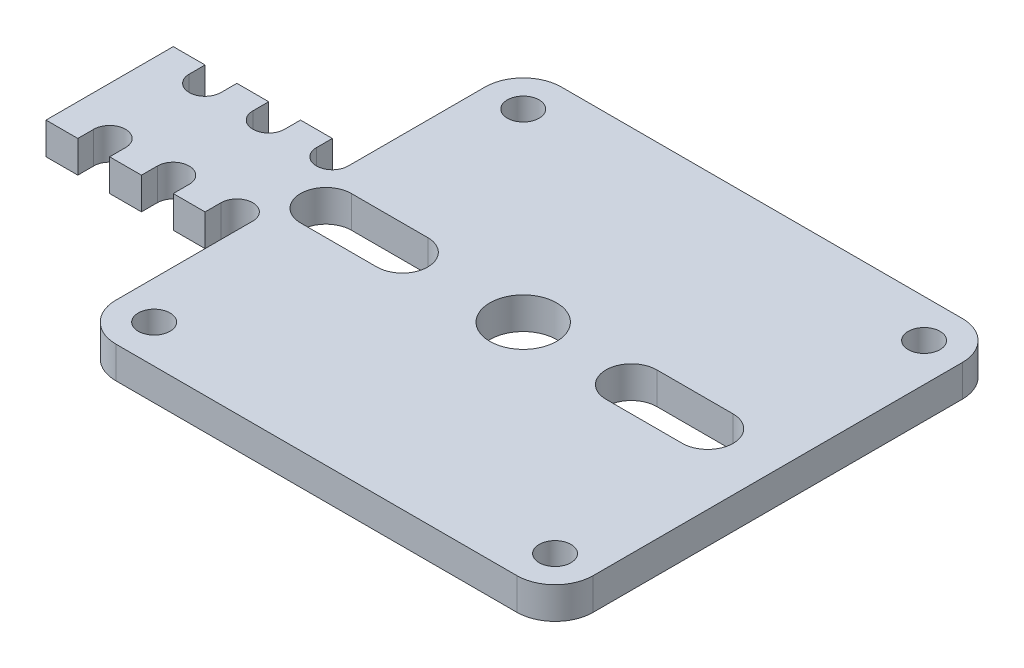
ISO-10303-21;
HEADER;
FILE_DESCRIPTION(('STEP AP214'),'2;1');
FILE_NAME('part.step','',(''),(''),'','','');
FILE_SCHEMA(('AUTOMOTIVE_DESIGN { 1 0 10303 214 1 1 1 1 }'));
ENDSEC;
DATA;
#1=APPLICATION_CONTEXT('core data for automotive mechanical design processes');
#2=APPLICATION_PROTOCOL_DEFINITION('international standard','automotive_design',2000,#1);
#3=PRODUCT_CONTEXT('',#1,'mechanical');
#4=PRODUCT('Part','Part','',(#3));
#5=PRODUCT_RELATED_PRODUCT_CATEGORY('part','',(#4));
#6=PRODUCT_DEFINITION_FORMATION('','',#4);
#7=PRODUCT_DEFINITION_CONTEXT('part definition',#1,'design');
#8=PRODUCT_DEFINITION('design','',#6,#7);
#9=PRODUCT_DEFINITION_SHAPE('','',#8);
#10=(LENGTH_UNIT() NAMED_UNIT(*) SI_UNIT(.MILLI.,.METRE.));
#11=(NAMED_UNIT(*) PLANE_ANGLE_UNIT() SI_UNIT($,.RADIAN.));
#12=(NAMED_UNIT(*) SI_UNIT($,.STERADIAN.) SOLID_ANGLE_UNIT());
#13=UNCERTAINTY_MEASURE_WITH_UNIT(LENGTH_MEASURE(1.E-05),#10,'distance_accuracy_value','');
#14=(GEOMETRIC_REPRESENTATION_CONTEXT(3) GLOBAL_UNCERTAINTY_ASSIGNED_CONTEXT((#13)) GLOBAL_UNIT_ASSIGNED_CONTEXT((#10,
#11,#12)) REPRESENTATION_CONTEXT('',''));
#15=CARTESIAN_POINT('',(0.,0.,0.));
#16=DIRECTION('',(0.,0.,1.));
#17=DIRECTION('',(1.,0.,0.));
#18=AXIS2_PLACEMENT_3D('',#15,#16,#17);
#19=CARTESIAN_POINT('',(36.,5.,-64.));
#20=DIRECTION('',(0.,-1.,0.));
#21=DIRECTION('',(0.,0.,-1.));
#22=AXIS2_PLACEMENT_3D('',#19,#20,#21);
#23=PLANE('',#22);
#24=CARTESIAN_POINT('',(36.,5.,-6.));
#25=DIRECTION('',(0.,1.,0.));
#26=DIRECTION('',(0.,0.,1.));
#27=AXIS2_PLACEMENT_3D('',#24,#25,#26);
#28=CIRCLE('',#27,2.5);
#29=CARTESIAN_POINT('',(36.,5.,-3.5));
#30=VERTEX_POINT('',#29);
#31=EDGE_CURVE('E1160',#30,#30,#28,.T.);
#32=ORIENTED_EDGE('',*,*,#31,.F.);
#33=EDGE_LOOP('',(#32));
#34=FACE_BOUND('',#33,.T.);
#35=CARTESIAN_POINT('',(99.,5.,-64.));
#36=DIRECTION('',(0.,1.,0.));
#37=DIRECTION('',(0.,0.,1.));
#38=AXIS2_PLACEMENT_3D('',#35,#36,#37);
#39=CIRCLE('',#38,2.50000000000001);
#40=CARTESIAN_POINT('',(99.,5.,-61.5));
#41=VERTEX_POINT('',#40);
#42=EDGE_CURVE('E1172',#41,#41,#39,.T.);
#43=ORIENTED_EDGE('',*,*,#42,.F.);
#44=EDGE_LOOP('',(#43));
#45=FACE_BOUND('',#44,.T.);
#46=CARTESIAN_POINT('',(82.,5.,-35.));
#47=DIRECTION('',(0.,1.,0.));
#48=DIRECTION('',(0.,0.,1.));
#49=AXIS2_PLACEMENT_3D('',#46,#47,#48);
#50=CIRCLE('',#49,4.);
#51=CARTESIAN_POINT('',(82.,5.,-39.));
#52=VERTEX_POINT('',#51);
#53=CARTESIAN_POINT('',(82.,5.,-31.));
#54=VERTEX_POINT('',#53);
#55=EDGE_CURVE('E306',#52,#54,#50,.T.);
#56=ORIENTED_EDGE('',*,*,#55,.F.);
#57=DIRECTION('',(-1.,0.,0.));
#58=VECTOR('',#57,1.);
#59=CARTESIAN_POINT('',(82.,5.,-39.));
#60=LINE('',#59,#58);
#61=CARTESIAN_POINT('',(94.,5.,-39.));
#62=VERTEX_POINT('',#61);
#63=EDGE_CURVE('E327',#62,#52,#60,.T.);
#64=ORIENTED_EDGE('',*,*,#63,.F.);
#65=CARTESIAN_POINT('',(94.,5.,-35.));
#66=DIRECTION('',(0.,1.,0.));
#67=DIRECTION('',(0.,0.,1.));
#68=AXIS2_PLACEMENT_3D('',#65,#66,#67);
#69=CIRCLE('',#68,4.);
#70=CARTESIAN_POINT('',(94.,5.,-31.));
#71=VERTEX_POINT('',#70);
#72=EDGE_CURVE('E325',#71,#62,#69,.T.);
#73=ORIENTED_EDGE('',*,*,#72,.F.);
#74=DIRECTION('',(1.,0.,0.));
#75=VECTOR('',#74,1.);
#76=CARTESIAN_POINT('',(82.,5.,-31.));
#77=LINE('',#76,#75);
#78=EDGE_CURVE('E323',#54,#71,#77,.T.);
#79=ORIENTED_EDGE('',*,*,#78,.F.);
#80=EDGE_LOOP('',(#56,#64,#73,#79));
#81=FACE_BOUND('',#80,.T.);
#82=CARTESIAN_POINT('',(36.,5.,-64.));
#83=DIRECTION('',(0.,1.,0.));
#84=DIRECTION('',(0.,0.,-1.));
#85=AXIS2_PLACEMENT_3D('',#82,#83,#84);
#86=CIRCLE('',#85,6.);
#87=CARTESIAN_POINT('',(36.,5.,-70.));
#88=VERTEX_POINT('',#87);
#89=CARTESIAN_POINT('',(30.,5.,-64.));
#90=VERTEX_POINT('',#89);
#91=EDGE_CURVE('E428',#88,#90,#86,.T.);
#92=ORIENTED_EDGE('',*,*,#91,.T.);
#93=DIRECTION('',(0.,0.,1.));
#94=VECTOR('',#93,1.);
#95=CARTESIAN_POINT('',(30.,5.,-42.5));
#96=LINE('',#95,#94);
#97=CARTESIAN_POINT('',(30.,5.,-42.5));
#98=VERTEX_POINT('',#97);
#99=EDGE_CURVE('E431',#90,#98,#96,.T.);
#100=ORIENTED_EDGE('',*,*,#99,.T.);
#101=CARTESIAN_POINT('',(27.5,5.,-42.5));
#102=DIRECTION('',(0.,-1.,0.));
#103=DIRECTION('',(0.,0.,1.));
#104=AXIS2_PLACEMENT_3D('',#101,#102,#103);
#105=CIRCLE('',#104,2.5);
#106=CARTESIAN_POINT('',(25.,5.,-42.5));
#107=VERTEX_POINT('',#106);
#108=EDGE_CURVE('E433',#98,#107,#105,.T.);
#109=ORIENTED_EDGE('',*,*,#108,.T.);
#110=DIRECTION('',(0.,0.,-1.));
#111=VECTOR('',#110,1.);
#112=CARTESIAN_POINT('',(25.,5.,-42.5));
#113=LINE('',#112,#111);
#114=CARTESIAN_POINT('',(25.,5.,-45.));
#115=VERTEX_POINT('',#114);
#116=EDGE_CURVE('E435',#107,#115,#113,.T.);
#117=ORIENTED_EDGE('',*,*,#116,.T.);
#118=DIRECTION('',(-1.,0.,0.));
#119=VECTOR('',#118,1.);
#120=CARTESIAN_POINT('',(20.,5.,-45.));
#121=LINE('',#120,#119);
#122=CARTESIAN_POINT('',(20.,5.,-45.));
#123=VERTEX_POINT('',#122);
#124=EDGE_CURVE('E437',#115,#123,#121,.T.);
#125=ORIENTED_EDGE('',*,*,#124,.T.);
#126=DIRECTION('',(0.,0.,1.));
#127=VECTOR('',#126,1.);
#128=CARTESIAN_POINT('',(20.,5.,-42.5));
#129=LINE('',#128,#127);
#130=CARTESIAN_POINT('',(20.,5.,-42.5));
#131=VERTEX_POINT('',#130);
#132=EDGE_CURVE('E439',#123,#131,#129,.T.);
#133=ORIENTED_EDGE('',*,*,#132,.T.);
#134=CARTESIAN_POINT('',(17.5,5.,-42.5));
#135=DIRECTION('',(0.,-1.,0.));
#136=DIRECTION('',(0.,0.,1.));
#137=AXIS2_PLACEMENT_3D('',#134,#135,#136);
#138=CIRCLE('',#137,2.5);
#139=CARTESIAN_POINT('',(15.,5.,-42.5));
#140=VERTEX_POINT('',#139);
#141=EDGE_CURVE('E441',#131,#140,#138,.T.);
#142=ORIENTED_EDGE('',*,*,#141,.T.);
#143=DIRECTION('',(0.,0.,-1.));
#144=VECTOR('',#143,1.);
#145=CARTESIAN_POINT('',(15.,5.,-42.5));
#146=LINE('',#145,#144);
#147=CARTESIAN_POINT('',(15.,5.,-45.));
#148=VERTEX_POINT('',#147);
#149=EDGE_CURVE('E443',#140,#148,#146,.T.);
#150=ORIENTED_EDGE('',*,*,#149,.T.);
#151=DIRECTION('',(-1.,0.,0.));
#152=VECTOR('',#151,1.);
#153=CARTESIAN_POINT('',(10.,5.,-45.));
#154=LINE('',#153,#152);
#155=CARTESIAN_POINT('',(10.,5.,-45.));
#156=VERTEX_POINT('',#155);
#157=EDGE_CURVE('E445',#148,#156,#154,.T.);
#158=ORIENTED_EDGE('',*,*,#157,.T.);
#159=DIRECTION('',(0.,0.,1.));
#160=VECTOR('',#159,1.);
#161=CARTESIAN_POINT('',(10.,5.,-42.5));
#162=LINE('',#161,#160);
#163=CARTESIAN_POINT('',(10.,5.,-42.5));
#164=VERTEX_POINT('',#163);
#165=EDGE_CURVE('E447',#156,#164,#162,.T.);
#166=ORIENTED_EDGE('',*,*,#165,.T.);
#167=CARTESIAN_POINT('',(7.5,5.,-42.5));
#168=DIRECTION('',(0.,-1.,0.));
#169=DIRECTION('',(0.,0.,1.));
#170=AXIS2_PLACEMENT_3D('',#167,#168,#169);
#171=CIRCLE('',#170,2.5);
#172=CARTESIAN_POINT('',(5.,5.,-42.5));
#173=VERTEX_POINT('',#172);
#174=EDGE_CURVE('E449',#164,#173,#171,.T.);
#175=ORIENTED_EDGE('',*,*,#174,.T.);
#176=DIRECTION('',(0.,0.,-1.));
#177=VECTOR('',#176,1.);
#178=CARTESIAN_POINT('',(5.,5.,-42.5));
#179=LINE('',#178,#177);
#180=CARTESIAN_POINT('',(5.,5.,-45.));
#181=VERTEX_POINT('',#180);
#182=EDGE_CURVE('E451',#173,#181,#179,.T.);
#183=ORIENTED_EDGE('',*,*,#182,.T.);
#184=DIRECTION('',(-1.,0.,0.));
#185=VECTOR('',#184,1.);
#186=CARTESIAN_POINT('',(0.,5.,-45.));
#187=LINE('',#186,#185);
#188=CARTESIAN_POINT('',(0.,5.,-45.));
#189=VERTEX_POINT('',#188);
#190=EDGE_CURVE('E453',#181,#189,#187,.T.);
#191=ORIENTED_EDGE('',*,*,#190,.T.);
#192=DIRECTION('',(0.,0.,1.));
#193=VECTOR('',#192,1.);
#194=CARTESIAN_POINT('',(0.,5.,-25.));
#195=LINE('',#194,#193);
#196=CARTESIAN_POINT('',(0.,5.,-25.));
#197=VERTEX_POINT('',#196);
#198=EDGE_CURVE('E455',#189,#197,#195,.T.);
#199=ORIENTED_EDGE('',*,*,#198,.T.);
#200=DIRECTION('',(1.,0.,0.));
#201=VECTOR('',#200,1.);
#202=CARTESIAN_POINT('',(0.,5.,-25.));
#203=LINE('',#202,#201);
#204=CARTESIAN_POINT('',(5.,5.,-25.));
#205=VERTEX_POINT('',#204);
#206=EDGE_CURVE('E457',#197,#205,#203,.T.);
#207=ORIENTED_EDGE('',*,*,#206,.T.);
#208=DIRECTION('',(0.,0.,-1.));
#209=VECTOR('',#208,1.);
#210=CARTESIAN_POINT('',(5.,5.,-27.5));
#211=LINE('',#210,#209);
#212=CARTESIAN_POINT('',(5.,5.,-27.5));
#213=VERTEX_POINT('',#212);
#214=EDGE_CURVE('E459',#205,#213,#211,.T.);
#215=ORIENTED_EDGE('',*,*,#214,.T.);
#216=CARTESIAN_POINT('',(7.5,5.,-27.5));
#217=DIRECTION('',(0.,-1.,0.));
#218=DIRECTION('',(0.,0.,1.));
#219=AXIS2_PLACEMENT_3D('',#216,#217,#218);
#220=CIRCLE('',#219,2.5);
#221=CARTESIAN_POINT('',(10.,5.,-27.5));
#222=VERTEX_POINT('',#221);
#223=EDGE_CURVE('E461',#213,#222,#220,.T.);
#224=ORIENTED_EDGE('',*,*,#223,.T.);
#225=DIRECTION('',(0.,0.,1.));
#226=VECTOR('',#225,1.);
#227=CARTESIAN_POINT('',(10.,5.,-27.5));
#228=LINE('',#227,#226);
#229=CARTESIAN_POINT('',(10.,5.,-25.));
#230=VERTEX_POINT('',#229);
#231=EDGE_CURVE('E463',#222,#230,#228,.T.);
#232=ORIENTED_EDGE('',*,*,#231,.T.);
#233=DIRECTION('',(1.,0.,0.));
#234=VECTOR('',#233,1.);
#235=CARTESIAN_POINT('',(10.,5.,-25.));
#236=LINE('',#235,#234);
#237=CARTESIAN_POINT('',(15.,5.,-25.));
#238=VERTEX_POINT('',#237);
#239=EDGE_CURVE('E465',#230,#238,#236,.T.);
#240=ORIENTED_EDGE('',*,*,#239,.T.);
#241=DIRECTION('',(0.,0.,-1.));
#242=VECTOR('',#241,1.);
#243=CARTESIAN_POINT('',(15.,5.,-27.5));
#244=LINE('',#243,#242);
#245=CARTESIAN_POINT('',(15.,5.,-27.5));
#246=VERTEX_POINT('',#245);
#247=EDGE_CURVE('E467',#238,#246,#244,.T.);
#248=ORIENTED_EDGE('',*,*,#247,.T.);
#249=CARTESIAN_POINT('',(17.5,5.,-27.5));
#250=DIRECTION('',(0.,-1.,0.));
#251=DIRECTION('',(0.,0.,1.));
#252=AXIS2_PLACEMENT_3D('',#249,#250,#251);
#253=CIRCLE('',#252,2.5);
#254=CARTESIAN_POINT('',(20.,5.,-27.5));
#255=VERTEX_POINT('',#254);
#256=EDGE_CURVE('E469',#246,#255,#253,.T.);
#257=ORIENTED_EDGE('',*,*,#256,.T.);
#258=DIRECTION('',(0.,0.,1.));
#259=VECTOR('',#258,1.);
#260=CARTESIAN_POINT('',(20.,5.,-27.5));
#261=LINE('',#260,#259);
#262=CARTESIAN_POINT('',(20.,5.,-25.));
#263=VERTEX_POINT('',#262);
#264=EDGE_CURVE('E471',#255,#263,#261,.T.);
#265=ORIENTED_EDGE('',*,*,#264,.T.);
#266=DIRECTION('',(1.,0.,0.));
#267=VECTOR('',#266,1.);
#268=CARTESIAN_POINT('',(20.,5.,-25.));
#269=LINE('',#268,#267);
#270=CARTESIAN_POINT('',(25.,5.,-25.));
#271=VERTEX_POINT('',#270);
#272=EDGE_CURVE('E473',#263,#271,#269,.T.);
#273=ORIENTED_EDGE('',*,*,#272,.T.);
#274=DIRECTION('',(0.,0.,-1.));
#275=VECTOR('',#274,1.);
#276=CARTESIAN_POINT('',(25.,5.,-27.5));
#277=LINE('',#276,#275);
#278=CARTESIAN_POINT('',(25.,5.,-27.5));
#279=VERTEX_POINT('',#278);
#280=EDGE_CURVE('E475',#271,#279,#277,.T.);
#281=ORIENTED_EDGE('',*,*,#280,.T.);
#282=CARTESIAN_POINT('',(27.5,5.,-27.5));
#283=DIRECTION('',(0.,-1.,0.));
#284=DIRECTION('',(0.,0.,1.));
#285=AXIS2_PLACEMENT_3D('',#282,#283,#284);
#286=CIRCLE('',#285,2.5);
#287=CARTESIAN_POINT('',(30.,5.,-27.5));
#288=VERTEX_POINT('',#287);
#289=EDGE_CURVE('E477',#279,#288,#286,.T.);
#290=ORIENTED_EDGE('',*,*,#289,.T.);
#291=DIRECTION('',(0.,0.,1.));
#292=VECTOR('',#291,1.);
#293=CARTESIAN_POINT('',(30.,5.,-6.00000000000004));
#294=LINE('',#293,#292);
#295=CARTESIAN_POINT('',(30.,5.,-6.00000000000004));
#296=VERTEX_POINT('',#295);
#297=EDGE_CURVE('E479',#288,#296,#294,.T.);
#298=ORIENTED_EDGE('',*,*,#297,.T.);
#299=CARTESIAN_POINT('',(36.,5.,-6.));
#300=DIRECTION('',(0.,1.,0.));
#301=DIRECTION('',(0.,0.,-1.));
#302=AXIS2_PLACEMENT_3D('',#299,#300,#301);
#303=CIRCLE('',#302,6.);
#304=CARTESIAN_POINT('',(36.,5.,0.));
#305=VERTEX_POINT('',#304);
#306=EDGE_CURVE('E481',#296,#305,#303,.T.);
#307=ORIENTED_EDGE('',*,*,#306,.T.);
#308=DIRECTION('',(1.,0.,0.));
#309=VECTOR('',#308,1.);
#310=CARTESIAN_POINT('',(36.,5.,0.));
#311=LINE('',#310,#309);
#312=CARTESIAN_POINT('',(98.9999999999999,5.,0.));
#313=VERTEX_POINT('',#312);
#314=EDGE_CURVE('E483',#305,#313,#311,.T.);
#315=ORIENTED_EDGE('',*,*,#314,.T.);
#316=CARTESIAN_POINT('',(99.,5.,-6.));
#317=DIRECTION('',(0.,1.,0.));
#318=DIRECTION('',(0.,0.,1.));
#319=AXIS2_PLACEMENT_3D('',#316,#317,#318);
#320=CIRCLE('',#319,6.);
#321=CARTESIAN_POINT('',(105.,5.,-6.00000000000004));
#322=VERTEX_POINT('',#321);
#323=EDGE_CURVE('E485',#313,#322,#320,.T.);
#324=ORIENTED_EDGE('',*,*,#323,.T.);
#325=DIRECTION('',(0.,0.,-1.));
#326=VECTOR('',#325,1.);
#327=CARTESIAN_POINT('',(105.,5.,-6.00000000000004));
#328=LINE('',#327,#326);
#329=CARTESIAN_POINT('',(105.,5.,-64.));
#330=VERTEX_POINT('',#329);
#331=EDGE_CURVE('E487',#322,#330,#328,.T.);
#332=ORIENTED_EDGE('',*,*,#331,.T.);
#333=CARTESIAN_POINT('',(99.,5.,-64.));
#334=DIRECTION('',(0.,1.,0.));
#335=DIRECTION('',(0.,0.,1.));
#336=AXIS2_PLACEMENT_3D('',#333,#334,#335);
#337=CIRCLE('',#336,6.00000000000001);
#338=CARTESIAN_POINT('',(98.9999999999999,5.,-70.));
#339=VERTEX_POINT('',#338);
#340=EDGE_CURVE('E489',#330,#339,#337,.T.);
#341=ORIENTED_EDGE('',*,*,#340,.T.);
#342=DIRECTION('',(-1.,0.,0.));
#343=VECTOR('',#342,1.);
#344=CARTESIAN_POINT('',(36.,5.,-70.));
#345=LINE('',#344,#343);
#346=EDGE_CURVE('E491',#339,#88,#345,.T.);
#347=ORIENTED_EDGE('',*,*,#346,.T.);
#348=EDGE_LOOP('',(#92,#100,#109,#117,#125,#133,#142,#150,#158,#166,#175,#183,#191,#199,#207,
#215,#224,#232,#240,#248,#257,#265,#273,#281,#290,#298,#307,#315,#324,#332,#341,#347));
#349=FACE_BOUND('',#348,.T.);
#350=CARTESIAN_POINT('',(46.,5.,-35.));
#351=DIRECTION('',(0.,1.,0.));
#352=DIRECTION('',(0.,0.,1.));
#353=AXIS2_PLACEMENT_3D('',#350,#351,#352);
#354=CIRCLE('',#353,4.);
#355=CARTESIAN_POINT('',(46.,5.,-31.));
#356=VERTEX_POINT('',#355);
#357=CARTESIAN_POINT('',(46.,5.,-39.));
#358=VERTEX_POINT('',#357);
#359=EDGE_CURVE('E344',#356,#358,#354,.T.);
#360=ORIENTED_EDGE('',*,*,#359,.F.);
#361=DIRECTION('',(1.,0.,0.));
#362=VECTOR('',#361,1.);
#363=CARTESIAN_POINT('',(34.,5.,-31.));
#364=LINE('',#363,#362);
#365=CARTESIAN_POINT('',(34.,5.,-31.));
#366=VERTEX_POINT('',#365);
#367=EDGE_CURVE('E351',#366,#356,#364,.T.);
#368=ORIENTED_EDGE('',*,*,#367,.F.);
#369=CARTESIAN_POINT('',(34.,5.,-35.));
#370=DIRECTION('',(0.,1.,0.));
#371=DIRECTION('',(0.,0.,1.));
#372=AXIS2_PLACEMENT_3D('',#369,#370,#371);
#373=CIRCLE('',#372,4.);
#374=CARTESIAN_POINT('',(34.,5.,-39.));
#375=VERTEX_POINT('',#374);
#376=EDGE_CURVE('E348',#375,#366,#373,.T.);
#377=ORIENTED_EDGE('',*,*,#376,.F.);
#378=DIRECTION('',(-1.,0.,0.));
#379=VECTOR('',#378,1.);
#380=CARTESIAN_POINT('',(34.,5.,-39.));
#381=LINE('',#380,#379);
#382=EDGE_CURVE('E346',#358,#375,#381,.T.);
#383=ORIENTED_EDGE('',*,*,#382,.F.);
#384=EDGE_LOOP('',(#360,#368,#377,#383));
#385=FACE_BOUND('',#384,.T.);
#386=CARTESIAN_POINT('',(36.,5.,-64.));
#387=DIRECTION('',(0.,1.,0.));
#388=DIRECTION('',(0.,0.,1.));
#389=AXIS2_PLACEMENT_3D('',#386,#387,#388);
#390=CIRCLE('',#389,2.5);
#391=CARTESIAN_POINT('',(36.,5.,-61.5));
#392=VERTEX_POINT('',#391);
#393=EDGE_CURVE('E313',#392,#392,#390,.T.);
#394=ORIENTED_EDGE('',*,*,#393,.F.);
#395=EDGE_LOOP('',(#394));
#396=FACE_BOUND('',#395,.T.);
#397=CARTESIAN_POINT('',(99.,5.,-6.));
#398=DIRECTION('',(0.,1.,0.));
#399=DIRECTION('',(0.,0.,1.));
#400=AXIS2_PLACEMENT_3D('',#397,#398,#399);
#401=CIRCLE('',#400,2.50000000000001);
#402=CARTESIAN_POINT('',(99.,5.,-3.49999999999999));
#403=VERTEX_POINT('',#402);
#404=EDGE_CURVE('E1166',#403,#403,#401,.T.);
#405=ORIENTED_EDGE('',*,*,#404,.F.);
#406=EDGE_LOOP('',(#405));
#407=FACE_BOUND('',#406,.T.);
#408=CARTESIAN_POINT('',(65.,5.,-35.));
#409=DIRECTION('',(0.,1.,0.));
#410=DIRECTION('',(0.,0.,1.));
#411=AXIS2_PLACEMENT_3D('',#408,#409,#410);
#412=CIRCLE('',#411,5.25);
#413=CARTESIAN_POINT('',(65.,5.,-29.75));
#414=VERTEX_POINT('',#413);
#415=EDGE_CURVE('E1149',#414,#414,#412,.T.);
#416=ORIENTED_EDGE('',*,*,#415,.F.);
#417=EDGE_LOOP('',(#416));
#418=FACE_BOUND('',#417,.T.);
#419=ADVANCED_FACE('F34',(#34,#45,#81,#349,#385,#396,#407,#418),#23,.F.);
#420=CARTESIAN_POINT('',(36.,0.,-64.));
#421=DIRECTION('',(0.,-1.,0.));
#422=DIRECTION('',(0.,0.,-1.));
#423=AXIS2_PLACEMENT_3D('',#420,#421,#422);
#424=PLANE('',#423);
#425=CARTESIAN_POINT('',(36.,0.,-6.));
#426=DIRECTION('',(0.,1.,0.));
#427=DIRECTION('',(0.,0.,1.));
#428=AXIS2_PLACEMENT_3D('',#425,#426,#427);
#429=CIRCLE('',#428,2.5);
#430=CARTESIAN_POINT('',(36.,0.,-3.5));
#431=VERTEX_POINT('',#430);
#432=EDGE_CURVE('E1155',#431,#431,#429,.T.);
#433=ORIENTED_EDGE('',*,*,#432,.T.);
#434=EDGE_LOOP('',(#433));
#435=FACE_BOUND('',#434,.T.);
#436=CARTESIAN_POINT('',(99.,0.,-64.));
#437=DIRECTION('',(0.,1.,0.));
#438=DIRECTION('',(0.,0.,1.));
#439=AXIS2_PLACEMENT_3D('',#436,#437,#438);
#440=CIRCLE('',#439,2.50000000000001);
#441=CARTESIAN_POINT('',(99.,0.,-61.5));
#442=VERTEX_POINT('',#441);
#443=EDGE_CURVE('E1169',#442,#442,#440,.T.);
#444=ORIENTED_EDGE('',*,*,#443,.T.);
#445=EDGE_LOOP('',(#444));
#446=FACE_BOUND('',#445,.T.);
#447=DIRECTION('',(-1.,0.,0.));
#448=VECTOR('',#447,1.);
#449=CARTESIAN_POINT('',(82.,0.,-39.));
#450=LINE('',#449,#448);
#451=CARTESIAN_POINT('',(94.,0.,-39.));
#452=VERTEX_POINT('',#451);
#453=CARTESIAN_POINT('',(82.,0.,-39.));
#454=VERTEX_POINT('',#453);
#455=EDGE_CURVE('E312',#452,#454,#450,.T.);
#456=ORIENTED_EDGE('',*,*,#455,.T.);
#457=CARTESIAN_POINT('',(82.,0.,-35.));
#458=DIRECTION('',(0.,1.,0.));
#459=DIRECTION('',(0.,0.,1.));
#460=AXIS2_PLACEMENT_3D('',#457,#458,#459);
#461=CIRCLE('',#460,4.);
#462=CARTESIAN_POINT('',(82.,0.,-31.));
#463=VERTEX_POINT('',#462);
#464=EDGE_CURVE('E57',#454,#463,#461,.T.);
#465=ORIENTED_EDGE('',*,*,#464,.T.);
#466=DIRECTION('',(1.,0.,0.));
#467=VECTOR('',#466,1.);
#468=CARTESIAN_POINT('',(82.,0.,-31.));
#469=LINE('',#468,#467);
#470=CARTESIAN_POINT('',(94.,0.,-31.));
#471=VERTEX_POINT('',#470);
#472=EDGE_CURVE('E293',#463,#471,#469,.T.);
#473=ORIENTED_EDGE('',*,*,#472,.T.);
#474=CARTESIAN_POINT('',(94.,0.,-35.));
#475=DIRECTION('',(0.,1.,0.));
#476=DIRECTION('',(0.,0.,1.));
#477=AXIS2_PLACEMENT_3D('',#474,#475,#476);
#478=CIRCLE('',#477,4.);
#479=EDGE_CURVE('E302',#471,#452,#478,.T.);
#480=ORIENTED_EDGE('',*,*,#479,.T.);
#481=EDGE_LOOP('',(#456,#465,#473,#480));
#482=FACE_BOUND('',#481,.T.);
#483=CARTESIAN_POINT('',(36.,0.,-64.));
#484=DIRECTION('',(0.,1.,0.));
#485=DIRECTION('',(0.,0.,-1.));
#486=AXIS2_PLACEMENT_3D('',#483,#484,#485);
#487=CIRCLE('',#486,6.);
#488=CARTESIAN_POINT('',(36.,0.,-70.));
#489=VERTEX_POINT('',#488);
#490=CARTESIAN_POINT('',(30.,0.,-64.));
#491=VERTEX_POINT('',#490);
#492=EDGE_CURVE('E363',#489,#491,#487,.T.);
#493=ORIENTED_EDGE('',*,*,#492,.F.);
#494=DIRECTION('',(-1.,0.,0.));
#495=VECTOR('',#494,1.);
#496=CARTESIAN_POINT('',(36.,0.,-70.));
#497=LINE('',#496,#495);
#498=CARTESIAN_POINT('',(98.9999999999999,0.,-70.));
#499=VERTEX_POINT('',#498);
#500=EDGE_CURVE('E426',#499,#489,#497,.T.);
#501=ORIENTED_EDGE('',*,*,#500,.F.);
#502=CARTESIAN_POINT('',(99.,0.,-64.));
#503=DIRECTION('',(0.,1.,0.));
#504=DIRECTION('',(0.,0.,1.));
#505=AXIS2_PLACEMENT_3D('',#502,#503,#504);
#506=CIRCLE('',#505,6.00000000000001);
#507=CARTESIAN_POINT('',(105.,0.,-64.));
#508=VERTEX_POINT('',#507);
#509=EDGE_CURVE('E424',#508,#499,#506,.T.);
#510=ORIENTED_EDGE('',*,*,#509,.F.);
#511=DIRECTION('',(0.,0.,-1.));
#512=VECTOR('',#511,1.);
#513=CARTESIAN_POINT('',(105.,0.,-6.00000000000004));
#514=LINE('',#513,#512);
#515=CARTESIAN_POINT('',(105.,0.,-6.00000000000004));
#516=VERTEX_POINT('',#515);
#517=EDGE_CURVE('E422',#516,#508,#514,.T.);
#518=ORIENTED_EDGE('',*,*,#517,.F.);
#519=CARTESIAN_POINT('',(99.,0.,-6.));
#520=DIRECTION('',(0.,1.,0.));
#521=DIRECTION('',(0.,0.,1.));
#522=AXIS2_PLACEMENT_3D('',#519,#520,#521);
#523=CIRCLE('',#522,6.);
#524=CARTESIAN_POINT('',(98.9999999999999,0.,0.));
#525=VERTEX_POINT('',#524);
#526=EDGE_CURVE('E420',#525,#516,#523,.T.);
#527=ORIENTED_EDGE('',*,*,#526,.F.);
#528=DIRECTION('',(1.,0.,0.));
#529=VECTOR('',#528,1.);
#530=CARTESIAN_POINT('',(36.,0.,0.));
#531=LINE('',#530,#529);
#532=CARTESIAN_POINT('',(36.,0.,0.));
#533=VERTEX_POINT('',#532);
#534=EDGE_CURVE('E418',#533,#525,#531,.T.);
#535=ORIENTED_EDGE('',*,*,#534,.F.);
#536=CARTESIAN_POINT('',(36.,0.,-6.));
#537=DIRECTION('',(0.,1.,0.));
#538=DIRECTION('',(0.,0.,-1.));
#539=AXIS2_PLACEMENT_3D('',#536,#537,#538);
#540=CIRCLE('',#539,6.);
#541=CARTESIAN_POINT('',(30.,0.,-6.00000000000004));
#542=VERTEX_POINT('',#541);
#543=EDGE_CURVE('E416',#542,#533,#540,.T.);
#544=ORIENTED_EDGE('',*,*,#543,.F.);
#545=DIRECTION('',(0.,0.,1.));
#546=VECTOR('',#545,1.);
#547=CARTESIAN_POINT('',(30.,0.,-6.00000000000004));
#548=LINE('',#547,#546);
#549=CARTESIAN_POINT('',(30.,0.,-27.5));
#550=VERTEX_POINT('',#549);
#551=EDGE_CURVE('E414',#550,#542,#548,.T.);
#552=ORIENTED_EDGE('',*,*,#551,.F.);
#553=CARTESIAN_POINT('',(27.5,0.,-27.5));
#554=DIRECTION('',(0.,-1.,0.));
#555=DIRECTION('',(0.,0.,1.));
#556=AXIS2_PLACEMENT_3D('',#553,#554,#555);
#557=CIRCLE('',#556,2.5);
#558=CARTESIAN_POINT('',(25.,0.,-27.5));
#559=VERTEX_POINT('',#558);
#560=EDGE_CURVE('E412',#559,#550,#557,.T.);
#561=ORIENTED_EDGE('',*,*,#560,.F.);
#562=DIRECTION('',(0.,0.,-1.));
#563=VECTOR('',#562,1.);
#564=CARTESIAN_POINT('',(25.,0.,-27.5));
#565=LINE('',#564,#563);
#566=CARTESIAN_POINT('',(25.,0.,-25.));
#567=VERTEX_POINT('',#566);
#568=EDGE_CURVE('E410',#567,#559,#565,.T.);
#569=ORIENTED_EDGE('',*,*,#568,.F.);
#570=DIRECTION('',(1.,0.,0.));
#571=VECTOR('',#570,1.);
#572=CARTESIAN_POINT('',(20.,0.,-25.));
#573=LINE('',#572,#571);
#574=CARTESIAN_POINT('',(20.,0.,-25.));
#575=VERTEX_POINT('',#574);
#576=EDGE_CURVE('E408',#575,#567,#573,.T.);
#577=ORIENTED_EDGE('',*,*,#576,.F.);
#578=DIRECTION('',(0.,0.,1.));
#579=VECTOR('',#578,1.);
#580=CARTESIAN_POINT('',(20.,0.,-27.5));
#581=LINE('',#580,#579);
#582=CARTESIAN_POINT('',(20.,0.,-27.5));
#583=VERTEX_POINT('',#582);
#584=EDGE_CURVE('E406',#583,#575,#581,.T.);
#585=ORIENTED_EDGE('',*,*,#584,.F.);
#586=CARTESIAN_POINT('',(17.5,0.,-27.5));
#587=DIRECTION('',(0.,-1.,0.));
#588=DIRECTION('',(0.,0.,1.));
#589=AXIS2_PLACEMENT_3D('',#586,#587,#588);
#590=CIRCLE('',#589,2.5);
#591=CARTESIAN_POINT('',(15.,0.,-27.5));
#592=VERTEX_POINT('',#591);
#593=EDGE_CURVE('E404',#592,#583,#590,.T.);
#594=ORIENTED_EDGE('',*,*,#593,.F.);
#595=DIRECTION('',(0.,0.,-1.));
#596=VECTOR('',#595,1.);
#597=CARTESIAN_POINT('',(15.,0.,-27.5));
#598=LINE('',#597,#596);
#599=CARTESIAN_POINT('',(15.,0.,-25.));
#600=VERTEX_POINT('',#599);
#601=EDGE_CURVE('E402',#600,#592,#598,.T.);
#602=ORIENTED_EDGE('',*,*,#601,.F.);
#603=DIRECTION('',(1.,0.,0.));
#604=VECTOR('',#603,1.);
#605=CARTESIAN_POINT('',(10.,0.,-25.));
#606=LINE('',#605,#604);
#607=CARTESIAN_POINT('',(10.,0.,-25.));
#608=VERTEX_POINT('',#607);
#609=EDGE_CURVE('E400',#608,#600,#606,.T.);
#610=ORIENTED_EDGE('',*,*,#609,.F.);
#611=DIRECTION('',(0.,0.,1.));
#612=VECTOR('',#611,1.);
#613=CARTESIAN_POINT('',(10.,0.,-27.5));
#614=LINE('',#613,#612);
#615=CARTESIAN_POINT('',(10.,0.,-27.5));
#616=VERTEX_POINT('',#615);
#617=EDGE_CURVE('E398',#616,#608,#614,.T.);
#618=ORIENTED_EDGE('',*,*,#617,.F.);
#619=CARTESIAN_POINT('',(7.5,0.,-27.5));
#620=DIRECTION('',(0.,-1.,0.));
#621=DIRECTION('',(0.,0.,1.));
#622=AXIS2_PLACEMENT_3D('',#619,#620,#621);
#623=CIRCLE('',#622,2.5);
#624=CARTESIAN_POINT('',(5.,0.,-27.5));
#625=VERTEX_POINT('',#624);
#626=EDGE_CURVE('E396',#625,#616,#623,.T.);
#627=ORIENTED_EDGE('',*,*,#626,.F.);
#628=DIRECTION('',(0.,0.,-1.));
#629=VECTOR('',#628,1.);
#630=CARTESIAN_POINT('',(5.,0.,-27.5));
#631=LINE('',#630,#629);
#632=CARTESIAN_POINT('',(5.,0.,-25.));
#633=VERTEX_POINT('',#632);
#634=EDGE_CURVE('E394',#633,#625,#631,.T.);
#635=ORIENTED_EDGE('',*,*,#634,.F.);
#636=DIRECTION('',(1.,0.,0.));
#637=VECTOR('',#636,1.);
#638=CARTESIAN_POINT('',(0.,0.,-25.));
#639=LINE('',#638,#637);
#640=CARTESIAN_POINT('',(0.,0.,-25.));
#641=VERTEX_POINT('',#640);
#642=EDGE_CURVE('E392',#641,#633,#639,.T.);
#643=ORIENTED_EDGE('',*,*,#642,.F.);
#644=DIRECTION('',(0.,0.,1.));
#645=VECTOR('',#644,1.);
#646=CARTESIAN_POINT('',(0.,0.,-25.));
#647=LINE('',#646,#645);
#648=CARTESIAN_POINT('',(0.,0.,-45.));
#649=VERTEX_POINT('',#648);
#650=EDGE_CURVE('E390',#649,#641,#647,.T.);
#651=ORIENTED_EDGE('',*,*,#650,.F.);
#652=DIRECTION('',(-1.,0.,0.));
#653=VECTOR('',#652,1.);
#654=CARTESIAN_POINT('',(0.,0.,-45.));
#655=LINE('',#654,#653);
#656=CARTESIAN_POINT('',(5.,0.,-45.));
#657=VERTEX_POINT('',#656);
#658=EDGE_CURVE('E388',#657,#649,#655,.T.);
#659=ORIENTED_EDGE('',*,*,#658,.F.);
#660=DIRECTION('',(0.,0.,-1.));
#661=VECTOR('',#660,1.);
#662=CARTESIAN_POINT('',(5.,0.,-42.5));
#663=LINE('',#662,#661);
#664=CARTESIAN_POINT('',(5.,0.,-42.5));
#665=VERTEX_POINT('',#664);
#666=EDGE_CURVE('E386',#665,#657,#663,.T.);
#667=ORIENTED_EDGE('',*,*,#666,.F.);
#668=CARTESIAN_POINT('',(7.5,0.,-42.5));
#669=DIRECTION('',(0.,-1.,0.));
#670=DIRECTION('',(0.,0.,1.));
#671=AXIS2_PLACEMENT_3D('',#668,#669,#670);
#672=CIRCLE('',#671,2.5);
#673=CARTESIAN_POINT('',(10.,0.,-42.5));
#674=VERTEX_POINT('',#673);
#675=EDGE_CURVE('E384',#674,#665,#672,.T.);
#676=ORIENTED_EDGE('',*,*,#675,.F.);
#677=DIRECTION('',(0.,0.,1.));
#678=VECTOR('',#677,1.);
#679=CARTESIAN_POINT('',(10.,0.,-42.5));
#680=LINE('',#679,#678);
#681=CARTESIAN_POINT('',(10.,0.,-45.));
#682=VERTEX_POINT('',#681);
#683=EDGE_CURVE('E382',#682,#674,#680,.T.);
#684=ORIENTED_EDGE('',*,*,#683,.F.);
#685=DIRECTION('',(-1.,0.,0.));
#686=VECTOR('',#685,1.);
#687=CARTESIAN_POINT('',(10.,0.,-45.));
#688=LINE('',#687,#686);
#689=CARTESIAN_POINT('',(15.,0.,-45.));
#690=VERTEX_POINT('',#689);
#691=EDGE_CURVE('E380',#690,#682,#688,.T.);
#692=ORIENTED_EDGE('',*,*,#691,.F.);
#693=DIRECTION('',(0.,0.,-1.));
#694=VECTOR('',#693,1.);
#695=CARTESIAN_POINT('',(15.,0.,-42.5));
#696=LINE('',#695,#694);
#697=CARTESIAN_POINT('',(15.,0.,-42.5));
#698=VERTEX_POINT('',#697);
#699=EDGE_CURVE('E378',#698,#690,#696,.T.);
#700=ORIENTED_EDGE('',*,*,#699,.F.);
#701=CARTESIAN_POINT('',(17.5,0.,-42.5));
#702=DIRECTION('',(0.,-1.,0.));
#703=DIRECTION('',(0.,0.,1.));
#704=AXIS2_PLACEMENT_3D('',#701,#702,#703);
#705=CIRCLE('',#704,2.5);
#706=CARTESIAN_POINT('',(20.,0.,-42.5));
#707=VERTEX_POINT('',#706);
#708=EDGE_CURVE('E376',#707,#698,#705,.T.);
#709=ORIENTED_EDGE('',*,*,#708,.F.);
#710=DIRECTION('',(0.,0.,1.));
#711=VECTOR('',#710,1.);
#712=CARTESIAN_POINT('',(20.,0.,-42.5));
#713=LINE('',#712,#711);
#714=CARTESIAN_POINT('',(20.,0.,-45.));
#715=VERTEX_POINT('',#714);
#716=EDGE_CURVE('E374',#715,#707,#713,.T.);
#717=ORIENTED_EDGE('',*,*,#716,.F.);
#718=DIRECTION('',(-1.,0.,0.));
#719=VECTOR('',#718,1.);
#720=CARTESIAN_POINT('',(20.,0.,-45.));
#721=LINE('',#720,#719);
#722=CARTESIAN_POINT('',(25.,0.,-45.));
#723=VERTEX_POINT('',#722);
#724=EDGE_CURVE('E372',#723,#715,#721,.T.);
#725=ORIENTED_EDGE('',*,*,#724,.F.);
#726=DIRECTION('',(0.,0.,-1.));
#727=VECTOR('',#726,1.);
#728=CARTESIAN_POINT('',(25.,0.,-42.5));
#729=LINE('',#728,#727);
#730=CARTESIAN_POINT('',(25.,0.,-42.5));
#731=VERTEX_POINT('',#730);
#732=EDGE_CURVE('E370',#731,#723,#729,.T.);
#733=ORIENTED_EDGE('',*,*,#732,.F.);
#734=CARTESIAN_POINT('',(27.5,0.,-42.5));
#735=DIRECTION('',(0.,-1.,0.));
#736=DIRECTION('',(0.,0.,1.));
#737=AXIS2_PLACEMENT_3D('',#734,#735,#736);
#738=CIRCLE('',#737,2.5);
#739=CARTESIAN_POINT('',(30.,0.,-42.5));
#740=VERTEX_POINT('',#739);
#741=EDGE_CURVE('E368',#740,#731,#738,.T.);
#742=ORIENTED_EDGE('',*,*,#741,.F.);
#743=DIRECTION('',(0.,0.,1.));
#744=VECTOR('',#743,1.);
#745=CARTESIAN_POINT('',(30.,0.,-42.5));
#746=LINE('',#745,#744);
#747=EDGE_CURVE('E366',#491,#740,#746,.T.);
#748=ORIENTED_EDGE('',*,*,#747,.F.);
#749=EDGE_LOOP('',(#493,#501,#510,#518,#527,#535,#544,#552,#561,#569,#577,#585,#594,#602,#610,
#618,#627,#635,#643,#651,#659,#667,#676,#684,#692,#700,#709,#717,#725,#733,#742,#748));
#750=FACE_BOUND('',#749,.T.);
#751=DIRECTION('',(1.,0.,0.));
#752=VECTOR('',#751,1.);
#753=CARTESIAN_POINT('',(34.,0.,-31.));
#754=LINE('',#753,#752);
#755=CARTESIAN_POINT('',(34.,0.,-31.));
#756=VERTEX_POINT('',#755);
#757=CARTESIAN_POINT('',(46.,0.,-31.));
#758=VERTEX_POINT('',#757);
#759=EDGE_CURVE('E341',#756,#758,#754,.T.);
#760=ORIENTED_EDGE('',*,*,#759,.T.);
#761=CARTESIAN_POINT('',(46.,0.,-35.));
#762=DIRECTION('',(0.,1.,0.));
#763=DIRECTION('',(0.,0.,1.));
#764=AXIS2_PLACEMENT_3D('',#761,#762,#763);
#765=CIRCLE('',#764,4.);
#766=CARTESIAN_POINT('',(46.,0.,-39.));
#767=VERTEX_POINT('',#766);
#768=EDGE_CURVE('E307',#758,#767,#765,.T.);
#769=ORIENTED_EDGE('',*,*,#768,.T.);
#770=DIRECTION('',(-1.,0.,0.));
#771=VECTOR('',#770,1.);
#772=CARTESIAN_POINT('',(34.,0.,-39.));
#773=LINE('',#772,#771);
#774=CARTESIAN_POINT('',(34.,0.,-39.));
#775=VERTEX_POINT('',#774);
#776=EDGE_CURVE('E335',#767,#775,#773,.T.);
#777=ORIENTED_EDGE('',*,*,#776,.T.);
#778=CARTESIAN_POINT('',(34.,0.,-35.));
#779=DIRECTION('',(0.,1.,0.));
#780=DIRECTION('',(0.,0.,1.));
#781=AXIS2_PLACEMENT_3D('',#778,#779,#780);
#782=CIRCLE('',#781,4.);
#783=EDGE_CURVE('E338',#775,#756,#782,.T.);
#784=ORIENTED_EDGE('',*,*,#783,.T.);
#785=EDGE_LOOP('',(#760,#769,#777,#784));
#786=FACE_BOUND('',#785,.T.);
#787=CARTESIAN_POINT('',(36.,0.,-64.));
#788=DIRECTION('',(0.,1.,0.));
#789=DIRECTION('',(0.,0.,1.));
#790=AXIS2_PLACEMENT_3D('',#787,#788,#789);
#791=CIRCLE('',#790,2.5);
#792=CARTESIAN_POINT('',(36.,0.,-61.5));
#793=VERTEX_POINT('',#792);
#794=EDGE_CURVE('E316',#793,#793,#791,.T.);
#795=ORIENTED_EDGE('',*,*,#794,.T.);
#796=EDGE_LOOP('',(#795));
#797=FACE_BOUND('',#796,.T.);
#798=CARTESIAN_POINT('',(99.,0.,-6.));
#799=DIRECTION('',(0.,1.,0.));
#800=DIRECTION('',(0.,0.,1.));
#801=AXIS2_PLACEMENT_3D('',#798,#799,#800);
#802=CIRCLE('',#801,2.50000000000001);
#803=CARTESIAN_POINT('',(99.,0.,-3.49999999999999));
#804=VERTEX_POINT('',#803);
#805=EDGE_CURVE('E1163',#804,#804,#802,.T.);
#806=ORIENTED_EDGE('',*,*,#805,.T.);
#807=EDGE_LOOP('',(#806));
#808=FACE_BOUND('',#807,.T.);
#809=CARTESIAN_POINT('',(65.,0.,-35.));
#810=DIRECTION('',(0.,1.,0.));
#811=DIRECTION('',(0.,0.,1.));
#812=AXIS2_PLACEMENT_3D('',#809,#810,#811);
#813=CIRCLE('',#812,5.25);
#814=CARTESIAN_POINT('',(65.,0.,-29.75));
#815=VERTEX_POINT('',#814);
#816=EDGE_CURVE('E1152',#815,#815,#813,.T.);
#817=ORIENTED_EDGE('',*,*,#816,.T.);
#818=EDGE_LOOP('',(#817));
#819=FACE_BOUND('',#818,.T.);
#820=ADVANCED_FACE('F310',(#435,#446,#482,#750,#786,#797,#808,#819),#424,.T.);
#821=CARTESIAN_POINT('',(36.,5.,-64.));
#822=DIRECTION('',(0.,-1.,0.));
#823=DIRECTION('',(0.,0.,-1.));
#824=AXIS2_PLACEMENT_3D('',#821,#822,#823);
#825=CYLINDRICAL_SURFACE('',#824,6.);
#826=ORIENTED_EDGE('',*,*,#492,.T.);
#827=DIRECTION('',(0.,-1.,0.));
#828=VECTOR('',#827,1.);
#829=CARTESIAN_POINT('',(30.,5.,-64.));
#830=LINE('',#829,#828);
#831=EDGE_CURVE('E11',#90,#491,#830,.T.);
#832=ORIENTED_EDGE('',*,*,#831,.F.);
#833=ORIENTED_EDGE('',*,*,#91,.F.);
#834=DIRECTION('',(0.,-1.,0.));
#835=VECTOR('',#834,1.);
#836=CARTESIAN_POINT('',(36.,5.,-70.));
#837=LINE('',#836,#835);
#838=EDGE_CURVE('E493',#88,#489,#837,.T.);
#839=ORIENTED_EDGE('',*,*,#838,.T.);
#840=EDGE_LOOP('',(#826,#832,#833,#839));
#841=FACE_BOUND('',#840,.T.);
#842=ADVANCED_FACE('F36',(#841),#825,.T.);
#843=CARTESIAN_POINT('',(30.,5.,-42.5));
#844=DIRECTION('',(1.,0.,0.));
#845=DIRECTION('',(0.,0.,-1.));
#846=AXIS2_PLACEMENT_3D('',#843,#844,#845);
#847=PLANE('',#846);
#848=ORIENTED_EDGE('',*,*,#747,.T.);
#849=DIRECTION('',(0.,-1.,0.));
#850=VECTOR('',#849,1.);
#851=CARTESIAN_POINT('',(30.,5.,-42.5));
#852=LINE('',#851,#850);
#853=EDGE_CURVE('E42',#98,#740,#852,.T.);
#854=ORIENTED_EDGE('',*,*,#853,.F.);
#855=ORIENTED_EDGE('',*,*,#99,.F.);
#856=ORIENTED_EDGE('',*,*,#831,.T.);
#857=EDGE_LOOP('',(#848,#854,#855,#856));
#858=FACE_BOUND('',#857,.T.);
#859=ADVANCED_FACE('F609',(#858),#847,.F.);
#860=CARTESIAN_POINT('',(27.5,5.,-42.5));
#861=DIRECTION('',(0.,-1.,0.));
#862=DIRECTION('',(0.,0.,-1.));
#863=AXIS2_PLACEMENT_3D('',#860,#861,#862);
#864=CYLINDRICAL_SURFACE('',#863,2.5);
#865=ORIENTED_EDGE('',*,*,#741,.T.);
#866=DIRECTION('',(0.,-1.,0.));
#867=VECTOR('',#866,1.);
#868=CARTESIAN_POINT('',(25.,5.,-42.5));
#869=LINE('',#868,#867);
#870=EDGE_CURVE('E580',#107,#731,#869,.T.);
#871=ORIENTED_EDGE('',*,*,#870,.F.);
#872=ORIENTED_EDGE('',*,*,#108,.F.);
#873=ORIENTED_EDGE('',*,*,#853,.T.);
#874=EDGE_LOOP('',(#865,#871,#872,#873));
#875=FACE_BOUND('',#874,.T.);
#876=ADVANCED_FACE('F587',(#875),#864,.F.);
#877=CARTESIAN_POINT('',(25.,5.,-42.5));
#878=DIRECTION('',(-1.,0.,0.));
#879=DIRECTION('',(0.,0.,1.));
#880=AXIS2_PLACEMENT_3D('',#877,#878,#879);
#881=PLANE('',#880);
#882=ORIENTED_EDGE('',*,*,#732,.T.);
#883=DIRECTION('',(0.,-1.,0.));
#884=VECTOR('',#883,1.);
#885=CARTESIAN_POINT('',(25.,5.,-45.));
#886=LINE('',#885,#884);
#887=EDGE_CURVE('E577',#115,#723,#886,.T.);
#888=ORIENTED_EDGE('',*,*,#887,.F.);
#889=ORIENTED_EDGE('',*,*,#116,.F.);
#890=ORIENTED_EDGE('',*,*,#870,.T.);
#891=EDGE_LOOP('',(#882,#888,#889,#890));
#892=FACE_BOUND('',#891,.T.);
#893=ADVANCED_FACE('F597',(#892),#881,.F.);
#894=CARTESIAN_POINT('',(20.,5.,-45.));
#895=DIRECTION('',(0.,0.,1.));
#896=DIRECTION('',(1.,0.,0.));
#897=AXIS2_PLACEMENT_3D('',#894,#895,#896);
#898=PLANE('',#897);
#899=ORIENTED_EDGE('',*,*,#724,.T.);
#900=DIRECTION('',(0.,-1.,0.));
#901=VECTOR('',#900,1.);
#902=CARTESIAN_POINT('',(20.,5.,-45.));
#903=LINE('',#902,#901);
#904=EDGE_CURVE('E574',#123,#715,#903,.T.);
#905=ORIENTED_EDGE('',*,*,#904,.F.);
#906=ORIENTED_EDGE('',*,*,#124,.F.);
#907=ORIENTED_EDGE('',*,*,#887,.T.);
#908=EDGE_LOOP('',(#899,#905,#906,#907));
#909=FACE_BOUND('',#908,.T.);
#910=ADVANCED_FACE('F601',(#909),#898,.F.);
#911=CARTESIAN_POINT('',(20.,5.,-42.5));
#912=DIRECTION('',(1.,0.,0.));
#913=DIRECTION('',(0.,0.,-1.));
#914=AXIS2_PLACEMENT_3D('',#911,#912,#913);
#915=PLANE('',#914);
#916=ORIENTED_EDGE('',*,*,#716,.T.);
#917=DIRECTION('',(0.,-1.,0.));
#918=VECTOR('',#917,1.);
#919=CARTESIAN_POINT('',(20.,5.,-42.5));
#920=LINE('',#919,#918);
#921=EDGE_CURVE('E571',#131,#707,#920,.T.);
#922=ORIENTED_EDGE('',*,*,#921,.F.);
#923=ORIENTED_EDGE('',*,*,#132,.F.);
#924=ORIENTED_EDGE('',*,*,#904,.T.);
#925=EDGE_LOOP('',(#916,#922,#923,#924));
#926=FACE_BOUND('',#925,.T.);
#927=ADVANCED_FACE('F742',(#926),#915,.F.);
#928=CARTESIAN_POINT('',(17.5,5.,-42.5));
#929=DIRECTION('',(0.,-1.,0.));
#930=DIRECTION('',(0.,0.,-1.));
#931=AXIS2_PLACEMENT_3D('',#928,#929,#930);
#932=CYLINDRICAL_SURFACE('',#931,2.5);
#933=ORIENTED_EDGE('',*,*,#708,.T.);
#934=DIRECTION('',(0.,-1.,0.));
#935=VECTOR('',#934,1.);
#936=CARTESIAN_POINT('',(15.,5.,-42.5));
#937=LINE('',#936,#935);
#938=EDGE_CURVE('E568',#140,#698,#937,.T.);
#939=ORIENTED_EDGE('',*,*,#938,.F.);
#940=ORIENTED_EDGE('',*,*,#141,.F.);
#941=ORIENTED_EDGE('',*,*,#921,.T.);
#942=EDGE_LOOP('',(#933,#939,#940,#941));
#943=FACE_BOUND('',#942,.T.);
#944=ADVANCED_FACE('F740',(#943),#932,.F.);
#945=CARTESIAN_POINT('',(15.,5.,-42.5));
#946=DIRECTION('',(-1.,0.,0.));
#947=DIRECTION('',(0.,0.,1.));
#948=AXIS2_PLACEMENT_3D('',#945,#946,#947);
#949=PLANE('',#948);
#950=ORIENTED_EDGE('',*,*,#699,.T.);
#951=DIRECTION('',(0.,-1.,0.));
#952=VECTOR('',#951,1.);
#953=CARTESIAN_POINT('',(15.,5.,-45.));
#954=LINE('',#953,#952);
#955=EDGE_CURVE('E565',#148,#690,#954,.T.);
#956=ORIENTED_EDGE('',*,*,#955,.F.);
#957=ORIENTED_EDGE('',*,*,#149,.F.);
#958=ORIENTED_EDGE('',*,*,#938,.T.);
#959=EDGE_LOOP('',(#950,#956,#957,#958));
#960=FACE_BOUND('',#959,.T.);
#961=ADVANCED_FACE('F735',(#960),#949,.F.);
#962=CARTESIAN_POINT('',(10.,5.,-45.));
#963=DIRECTION('',(0.,0.,1.));
#964=DIRECTION('',(1.,0.,0.));
#965=AXIS2_PLACEMENT_3D('',#962,#963,#964);
#966=PLANE('',#965);
#967=ORIENTED_EDGE('',*,*,#691,.T.);
#968=DIRECTION('',(0.,-1.,0.));
#969=VECTOR('',#968,1.);
#970=CARTESIAN_POINT('',(10.,5.,-45.));
#971=LINE('',#970,#969);
#972=EDGE_CURVE('E562',#156,#682,#971,.T.);
#973=ORIENTED_EDGE('',*,*,#972,.F.);
#974=ORIENTED_EDGE('',*,*,#157,.F.);
#975=ORIENTED_EDGE('',*,*,#955,.T.);
#976=EDGE_LOOP('',(#967,#973,#974,#975));
#977=FACE_BOUND('',#976,.T.);
#978=ADVANCED_FACE('F730',(#977),#966,.F.);
#979=CARTESIAN_POINT('',(10.,5.,-42.5));
#980=DIRECTION('',(1.,0.,0.));
#981=DIRECTION('',(0.,0.,-1.));
#982=AXIS2_PLACEMENT_3D('',#979,#980,#981);
#983=PLANE('',#982);
#984=ORIENTED_EDGE('',*,*,#683,.T.);
#985=DIRECTION('',(0.,-1.,0.));
#986=VECTOR('',#985,1.);
#987=CARTESIAN_POINT('',(10.,5.,-42.5));
#988=LINE('',#987,#986);
#989=EDGE_CURVE('E559',#164,#674,#988,.T.);
#990=ORIENTED_EDGE('',*,*,#989,.F.);
#991=ORIENTED_EDGE('',*,*,#165,.F.);
#992=ORIENTED_EDGE('',*,*,#972,.T.);
#993=EDGE_LOOP('',(#984,#990,#991,#992));
#994=FACE_BOUND('',#993,.T.);
#995=ADVANCED_FACE('F726',(#994),#983,.F.);
#996=CARTESIAN_POINT('',(7.5,5.,-42.5));
#997=DIRECTION('',(0.,-1.,0.));
#998=DIRECTION('',(0.,0.,-1.));
#999=AXIS2_PLACEMENT_3D('',#996,#997,#998);
#1000=CYLINDRICAL_SURFACE('',#999,2.5);
#1001=ORIENTED_EDGE('',*,*,#675,.T.);
#1002=DIRECTION('',(0.,-1.,0.));
#1003=VECTOR('',#1002,1.);
#1004=CARTESIAN_POINT('',(5.,5.,-42.5));
#1005=LINE('',#1004,#1003);
#1006=EDGE_CURVE('E556',#173,#665,#1005,.T.);
#1007=ORIENTED_EDGE('',*,*,#1006,.F.);
#1008=ORIENTED_EDGE('',*,*,#174,.F.);
#1009=ORIENTED_EDGE('',*,*,#989,.T.);
#1010=EDGE_LOOP('',(#1001,#1007,#1008,#1009));
#1011=FACE_BOUND('',#1010,.T.);
#1012=ADVANCED_FACE('F721',(#1011),#1000,.F.);
#1013=CARTESIAN_POINT('',(5.,5.,-42.5));
#1014=DIRECTION('',(-1.,0.,0.));
#1015=DIRECTION('',(0.,0.,1.));
#1016=AXIS2_PLACEMENT_3D('',#1013,#1014,#1015);
#1017=PLANE('',#1016);
#1018=ORIENTED_EDGE('',*,*,#666,.T.);
#1019=DIRECTION('',(0.,-1.,0.));
#1020=VECTOR('',#1019,1.);
#1021=CARTESIAN_POINT('',(5.,5.,-45.));
#1022=LINE('',#1021,#1020);
#1023=EDGE_CURVE('E553',#181,#657,#1022,.T.);
#1024=ORIENTED_EDGE('',*,*,#1023,.F.);
#1025=ORIENTED_EDGE('',*,*,#182,.F.);
#1026=ORIENTED_EDGE('',*,*,#1006,.T.);
#1027=EDGE_LOOP('',(#1018,#1024,#1025,#1026));
#1028=FACE_BOUND('',#1027,.T.);
#1029=ADVANCED_FACE('F715',(#1028),#1017,.F.);
#1030=CARTESIAN_POINT('',(0.,5.,-45.));
#1031=DIRECTION('',(0.,0.,1.));
#1032=DIRECTION('',(1.,0.,0.));
#1033=AXIS2_PLACEMENT_3D('',#1030,#1031,#1032);
#1034=PLANE('',#1033);
#1035=ORIENTED_EDGE('',*,*,#658,.T.);
#1036=DIRECTION('',(0.,-1.,0.));
#1037=VECTOR('',#1036,1.);
#1038=CARTESIAN_POINT('',(0.,5.,-45.));
#1039=LINE('',#1038,#1037);
#1040=EDGE_CURVE('E550',#189,#649,#1039,.T.);
#1041=ORIENTED_EDGE('',*,*,#1040,.F.);
#1042=ORIENTED_EDGE('',*,*,#190,.F.);
#1043=ORIENTED_EDGE('',*,*,#1023,.T.);
#1044=EDGE_LOOP('',(#1035,#1041,#1042,#1043));
#1045=FACE_BOUND('',#1044,.T.);
#1046=ADVANCED_FACE('F711',(#1045),#1034,.F.);
#1047=CARTESIAN_POINT('',(0.,5.,-25.));
#1048=DIRECTION('',(1.,0.,0.));
#1049=DIRECTION('',(0.,0.,-1.));
#1050=AXIS2_PLACEMENT_3D('',#1047,#1048,#1049);
#1051=PLANE('',#1050);
#1052=ORIENTED_EDGE('',*,*,#650,.T.);
#1053=DIRECTION('',(0.,-1.,0.));
#1054=VECTOR('',#1053,1.);
#1055=CARTESIAN_POINT('',(0.,5.,-25.));
#1056=LINE('',#1055,#1054);
#1057=EDGE_CURVE('E547',#197,#641,#1056,.T.);
#1058=ORIENTED_EDGE('',*,*,#1057,.F.);
#1059=ORIENTED_EDGE('',*,*,#198,.F.);
#1060=ORIENTED_EDGE('',*,*,#1040,.T.);
#1061=EDGE_LOOP('',(#1052,#1058,#1059,#1060));
#1062=FACE_BOUND('',#1061,.T.);
#1063=ADVANCED_FACE('F706',(#1062),#1051,.F.);
#1064=CARTESIAN_POINT('',(0.,5.,-25.));
#1065=DIRECTION('',(0.,0.,-1.));
#1066=DIRECTION('',(-1.,0.,0.));
#1067=AXIS2_PLACEMENT_3D('',#1064,#1065,#1066);
#1068=PLANE('',#1067);
#1069=ORIENTED_EDGE('',*,*,#642,.T.);
#1070=DIRECTION('',(0.,-1.,0.));
#1071=VECTOR('',#1070,1.);
#1072=CARTESIAN_POINT('',(5.,5.,-25.));
#1073=LINE('',#1072,#1071);
#1074=EDGE_CURVE('E544',#205,#633,#1073,.T.);
#1075=ORIENTED_EDGE('',*,*,#1074,.F.);
#1076=ORIENTED_EDGE('',*,*,#206,.F.);
#1077=ORIENTED_EDGE('',*,*,#1057,.T.);
#1078=EDGE_LOOP('',(#1069,#1075,#1076,#1077));
#1079=FACE_BOUND('',#1078,.T.);
#1080=ADVANCED_FACE('F700',(#1079),#1068,.F.);
#1081=CARTESIAN_POINT('',(5.,5.,-27.5));
#1082=DIRECTION('',(-1.,0.,0.));
#1083=DIRECTION('',(0.,0.,1.));
#1084=AXIS2_PLACEMENT_3D('',#1081,#1082,#1083);
#1085=PLANE('',#1084);
#1086=ORIENTED_EDGE('',*,*,#634,.T.);
#1087=DIRECTION('',(0.,-1.,0.));
#1088=VECTOR('',#1087,1.);
#1089=CARTESIAN_POINT('',(5.,5.,-27.5));
#1090=LINE('',#1089,#1088);
#1091=EDGE_CURVE('E541',#213,#625,#1090,.T.);
#1092=ORIENTED_EDGE('',*,*,#1091,.F.);
#1093=ORIENTED_EDGE('',*,*,#214,.F.);
#1094=ORIENTED_EDGE('',*,*,#1074,.T.);
#1095=EDGE_LOOP('',(#1086,#1092,#1093,#1094));
#1096=FACE_BOUND('',#1095,.T.);
#1097=ADVANCED_FACE('F696',(#1096),#1085,.F.);
#1098=CARTESIAN_POINT('',(7.5,5.,-27.5));
#1099=DIRECTION('',(0.,-1.,0.));
#1100=DIRECTION('',(0.,0.,-1.));
#1101=AXIS2_PLACEMENT_3D('',#1098,#1099,#1100);
#1102=CYLINDRICAL_SURFACE('',#1101,2.5);
#1103=ORIENTED_EDGE('',*,*,#626,.T.);
#1104=DIRECTION('',(0.,-1.,0.));
#1105=VECTOR('',#1104,1.);
#1106=CARTESIAN_POINT('',(10.,5.,-27.5));
#1107=LINE('',#1106,#1105);
#1108=EDGE_CURVE('E538',#222,#616,#1107,.T.);
#1109=ORIENTED_EDGE('',*,*,#1108,.F.);
#1110=ORIENTED_EDGE('',*,*,#223,.F.);
#1111=ORIENTED_EDGE('',*,*,#1091,.T.);
#1112=EDGE_LOOP('',(#1103,#1109,#1110,#1111));
#1113=FACE_BOUND('',#1112,.T.);
#1114=ADVANCED_FACE('F691',(#1113),#1102,.F.);
#1115=CARTESIAN_POINT('',(10.,5.,-27.5));
#1116=DIRECTION('',(1.,0.,0.));
#1117=DIRECTION('',(0.,0.,-1.));
#1118=AXIS2_PLACEMENT_3D('',#1115,#1116,#1117);
#1119=PLANE('',#1118);
#1120=ORIENTED_EDGE('',*,*,#617,.T.);
#1121=DIRECTION('',(0.,-1.,0.));
#1122=VECTOR('',#1121,1.);
#1123=CARTESIAN_POINT('',(10.,5.,-25.));
#1124=LINE('',#1123,#1122);
#1125=EDGE_CURVE('E535',#230,#608,#1124,.T.);
#1126=ORIENTED_EDGE('',*,*,#1125,.F.);
#1127=ORIENTED_EDGE('',*,*,#231,.F.);
#1128=ORIENTED_EDGE('',*,*,#1108,.T.);
#1129=EDGE_LOOP('',(#1120,#1126,#1127,#1128));
#1130=FACE_BOUND('',#1129,.T.);
#1131=ADVANCED_FACE('F685',(#1130),#1119,.F.);
#1132=CARTESIAN_POINT('',(10.,5.,-25.));
#1133=DIRECTION('',(0.,0.,-1.));
#1134=DIRECTION('',(-1.,0.,0.));
#1135=AXIS2_PLACEMENT_3D('',#1132,#1133,#1134);
#1136=PLANE('',#1135);
#1137=ORIENTED_EDGE('',*,*,#609,.T.);
#1138=DIRECTION('',(0.,-1.,0.));
#1139=VECTOR('',#1138,1.);
#1140=CARTESIAN_POINT('',(15.,5.,-25.));
#1141=LINE('',#1140,#1139);
#1142=EDGE_CURVE('E532',#238,#600,#1141,.T.);
#1143=ORIENTED_EDGE('',*,*,#1142,.F.);
#1144=ORIENTED_EDGE('',*,*,#239,.F.);
#1145=ORIENTED_EDGE('',*,*,#1125,.T.);
#1146=EDGE_LOOP('',(#1137,#1143,#1144,#1145));
#1147=FACE_BOUND('',#1146,.T.);
#1148=ADVANCED_FACE('F681',(#1147),#1136,.F.);
#1149=CARTESIAN_POINT('',(15.,5.,-27.5));
#1150=DIRECTION('',(-1.,0.,0.));
#1151=DIRECTION('',(0.,0.,1.));
#1152=AXIS2_PLACEMENT_3D('',#1149,#1150,#1151);
#1153=PLANE('',#1152);
#1154=ORIENTED_EDGE('',*,*,#601,.T.);
#1155=DIRECTION('',(0.,-1.,0.));
#1156=VECTOR('',#1155,1.);
#1157=CARTESIAN_POINT('',(15.,5.,-27.5));
#1158=LINE('',#1157,#1156);
#1159=EDGE_CURVE('E529',#246,#592,#1158,.T.);
#1160=ORIENTED_EDGE('',*,*,#1159,.F.);
#1161=ORIENTED_EDGE('',*,*,#247,.F.);
#1162=ORIENTED_EDGE('',*,*,#1142,.T.);
#1163=EDGE_LOOP('',(#1154,#1160,#1161,#1162));
#1164=FACE_BOUND('',#1163,.T.);
#1165=ADVANCED_FACE('F676',(#1164),#1153,.F.);
#1166=CARTESIAN_POINT('',(17.5,5.,-27.5));
#1167=DIRECTION('',(0.,-1.,0.));
#1168=DIRECTION('',(0.,0.,-1.));
#1169=AXIS2_PLACEMENT_3D('',#1166,#1167,#1168);
#1170=CYLINDRICAL_SURFACE('',#1169,2.5);
#1171=ORIENTED_EDGE('',*,*,#593,.T.);
#1172=DIRECTION('',(0.,-1.,0.));
#1173=VECTOR('',#1172,1.);
#1174=CARTESIAN_POINT('',(20.,5.,-27.5));
#1175=LINE('',#1174,#1173);
#1176=EDGE_CURVE('E526',#255,#583,#1175,.T.);
#1177=ORIENTED_EDGE('',*,*,#1176,.F.);
#1178=ORIENTED_EDGE('',*,*,#256,.F.);
#1179=ORIENTED_EDGE('',*,*,#1159,.T.);
#1180=EDGE_LOOP('',(#1171,#1177,#1178,#1179));
#1181=FACE_BOUND('',#1180,.T.);
#1182=ADVANCED_FACE('F670',(#1181),#1170,.F.);
#1183=CARTESIAN_POINT('',(20.,5.,-27.5));
#1184=DIRECTION('',(1.,0.,0.));
#1185=DIRECTION('',(0.,0.,-1.));
#1186=AXIS2_PLACEMENT_3D('',#1183,#1184,#1185);
#1187=PLANE('',#1186);
#1188=ORIENTED_EDGE('',*,*,#584,.T.);
#1189=DIRECTION('',(0.,-1.,0.));
#1190=VECTOR('',#1189,1.);
#1191=CARTESIAN_POINT('',(20.,5.,-25.));
#1192=LINE('',#1191,#1190);
#1193=EDGE_CURVE('E523',#263,#575,#1192,.T.);
#1194=ORIENTED_EDGE('',*,*,#1193,.F.);
#1195=ORIENTED_EDGE('',*,*,#264,.F.);
#1196=ORIENTED_EDGE('',*,*,#1176,.T.);
#1197=EDGE_LOOP('',(#1188,#1194,#1195,#1196));
#1198=FACE_BOUND('',#1197,.T.);
#1199=ADVANCED_FACE('F666',(#1198),#1187,.F.);
#1200=CARTESIAN_POINT('',(20.,5.,-25.));
#1201=DIRECTION('',(0.,0.,-1.));
#1202=DIRECTION('',(-1.,0.,0.));
#1203=AXIS2_PLACEMENT_3D('',#1200,#1201,#1202);
#1204=PLANE('',#1203);
#1205=ORIENTED_EDGE('',*,*,#576,.T.);
#1206=DIRECTION('',(0.,-1.,0.));
#1207=VECTOR('',#1206,1.);
#1208=CARTESIAN_POINT('',(25.,5.,-25.));
#1209=LINE('',#1208,#1207);
#1210=EDGE_CURVE('E520',#271,#567,#1209,.T.);
#1211=ORIENTED_EDGE('',*,*,#1210,.F.);
#1212=ORIENTED_EDGE('',*,*,#272,.F.);
#1213=ORIENTED_EDGE('',*,*,#1193,.T.);
#1214=EDGE_LOOP('',(#1205,#1211,#1212,#1213));
#1215=FACE_BOUND('',#1214,.T.);
#1216=ADVANCED_FACE('F661',(#1215),#1204,.F.);
#1217=CARTESIAN_POINT('',(25.,5.,-27.5));
#1218=DIRECTION('',(-1.,0.,0.));
#1219=DIRECTION('',(0.,0.,1.));
#1220=AXIS2_PLACEMENT_3D('',#1217,#1218,#1219);
#1221=PLANE('',#1220);
#1222=ORIENTED_EDGE('',*,*,#568,.T.);
#1223=DIRECTION('',(0.,-1.,0.));
#1224=VECTOR('',#1223,1.);
#1225=CARTESIAN_POINT('',(25.,5.,-27.5));
#1226=LINE('',#1225,#1224);
#1227=EDGE_CURVE('E517',#279,#559,#1226,.T.);
#1228=ORIENTED_EDGE('',*,*,#1227,.F.);
#1229=ORIENTED_EDGE('',*,*,#280,.F.);
#1230=ORIENTED_EDGE('',*,*,#1210,.T.);
#1231=EDGE_LOOP('',(#1222,#1228,#1229,#1230));
#1232=FACE_BOUND('',#1231,.T.);
#1233=ADVANCED_FACE('F655',(#1232),#1221,.F.);
#1234=CARTESIAN_POINT('',(27.5,5.,-27.5));
#1235=DIRECTION('',(0.,-1.,0.));
#1236=DIRECTION('',(0.,0.,-1.));
#1237=AXIS2_PLACEMENT_3D('',#1234,#1235,#1236);
#1238=CYLINDRICAL_SURFACE('',#1237,2.5);
#1239=ORIENTED_EDGE('',*,*,#560,.T.);
#1240=DIRECTION('',(0.,-1.,0.));
#1241=VECTOR('',#1240,1.);
#1242=CARTESIAN_POINT('',(30.,5.,-27.5));
#1243=LINE('',#1242,#1241);
#1244=EDGE_CURVE('E514',#288,#550,#1243,.T.);
#1245=ORIENTED_EDGE('',*,*,#1244,.F.);
#1246=ORIENTED_EDGE('',*,*,#289,.F.);
#1247=ORIENTED_EDGE('',*,*,#1227,.T.);
#1248=EDGE_LOOP('',(#1239,#1245,#1246,#1247));
#1249=FACE_BOUND('',#1248,.T.);
#1250=ADVANCED_FACE('F651',(#1249),#1238,.F.);
#1251=CARTESIAN_POINT('',(30.,5.,-6.00000000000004));
#1252=DIRECTION('',(1.,0.,0.));
#1253=DIRECTION('',(0.,0.,-1.));
#1254=AXIS2_PLACEMENT_3D('',#1251,#1252,#1253);
#1255=PLANE('',#1254);
#1256=ORIENTED_EDGE('',*,*,#551,.T.);
#1257=DIRECTION('',(0.,-1.,0.));
#1258=VECTOR('',#1257,1.);
#1259=CARTESIAN_POINT('',(30.,5.,-6.00000000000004));
#1260=LINE('',#1259,#1258);
#1261=EDGE_CURVE('E511',#296,#542,#1260,.T.);
#1262=ORIENTED_EDGE('',*,*,#1261,.F.);
#1263=ORIENTED_EDGE('',*,*,#297,.F.);
#1264=ORIENTED_EDGE('',*,*,#1244,.T.);
#1265=EDGE_LOOP('',(#1256,#1262,#1263,#1264));
#1266=FACE_BOUND('',#1265,.T.);
#1267=ADVANCED_FACE('F646',(#1266),#1255,.F.);
#1268=CARTESIAN_POINT('',(36.,5.,-6.));
#1269=DIRECTION('',(0.,-1.,0.));
#1270=DIRECTION('',(0.,0.,-1.));
#1271=AXIS2_PLACEMENT_3D('',#1268,#1269,#1270);
#1272=CYLINDRICAL_SURFACE('',#1271,6.);
#1273=ORIENTED_EDGE('',*,*,#543,.T.);
#1274=DIRECTION('',(0.,-1.,0.));
#1275=VECTOR('',#1274,1.);
#1276=CARTESIAN_POINT('',(36.,5.,0.));
#1277=LINE('',#1276,#1275);
#1278=EDGE_CURVE('E508',#305,#533,#1277,.T.);
#1279=ORIENTED_EDGE('',*,*,#1278,.F.);
#1280=ORIENTED_EDGE('',*,*,#306,.F.);
#1281=ORIENTED_EDGE('',*,*,#1261,.T.);
#1282=EDGE_LOOP('',(#1273,#1279,#1280,#1281));
#1283=FACE_BOUND('',#1282,.T.);
#1284=ADVANCED_FACE('F640',(#1283),#1272,.T.);
#1285=CARTESIAN_POINT('',(36.,5.,0.));
#1286=DIRECTION('',(0.,0.,-1.));
#1287=DIRECTION('',(-1.,0.,0.));
#1288=AXIS2_PLACEMENT_3D('',#1285,#1286,#1287);
#1289=PLANE('',#1288);
#1290=ORIENTED_EDGE('',*,*,#534,.T.);
#1291=DIRECTION('',(0.,-1.,0.));
#1292=VECTOR('',#1291,1.);
#1293=CARTESIAN_POINT('',(98.9999999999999,5.,0.));
#1294=LINE('',#1293,#1292);
#1295=EDGE_CURVE('E505',#313,#525,#1294,.T.);
#1296=ORIENTED_EDGE('',*,*,#1295,.F.);
#1297=ORIENTED_EDGE('',*,*,#314,.F.);
#1298=ORIENTED_EDGE('',*,*,#1278,.T.);
#1299=EDGE_LOOP('',(#1290,#1296,#1297,#1298));
#1300=FACE_BOUND('',#1299,.T.);
#1301=ADVANCED_FACE('F636',(#1300),#1289,.F.);
#1302=CARTESIAN_POINT('',(99.,5.,-6.));
#1303=DIRECTION('',(0.,-1.,0.));
#1304=DIRECTION('',(0.,0.,-1.));
#1305=AXIS2_PLACEMENT_3D('',#1302,#1303,#1304);
#1306=CYLINDRICAL_SURFACE('',#1305,6.);
#1307=ORIENTED_EDGE('',*,*,#526,.T.);
#1308=DIRECTION('',(0.,-1.,0.));
#1309=VECTOR('',#1308,1.);
#1310=CARTESIAN_POINT('',(105.,5.,-6.00000000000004));
#1311=LINE('',#1310,#1309);
#1312=EDGE_CURVE('E502',#322,#516,#1311,.T.);
#1313=ORIENTED_EDGE('',*,*,#1312,.F.);
#1314=ORIENTED_EDGE('',*,*,#323,.F.);
#1315=ORIENTED_EDGE('',*,*,#1295,.T.);
#1316=EDGE_LOOP('',(#1307,#1313,#1314,#1315));
#1317=FACE_BOUND('',#1316,.T.);
#1318=ADVANCED_FACE('F631',(#1317),#1306,.T.);
#1319=CARTESIAN_POINT('',(105.,5.,-6.00000000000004));
#1320=DIRECTION('',(-1.,0.,0.));
#1321=DIRECTION('',(0.,0.,1.));
#1322=AXIS2_PLACEMENT_3D('',#1319,#1320,#1321);
#1323=PLANE('',#1322);
#1324=ORIENTED_EDGE('',*,*,#517,.T.);
#1325=DIRECTION('',(0.,-1.,0.));
#1326=VECTOR('',#1325,1.);
#1327=CARTESIAN_POINT('',(105.,5.,-64.));
#1328=LINE('',#1327,#1326);
#1329=EDGE_CURVE('E499',#330,#508,#1328,.T.);
#1330=ORIENTED_EDGE('',*,*,#1329,.F.);
#1331=ORIENTED_EDGE('',*,*,#331,.F.);
#1332=ORIENTED_EDGE('',*,*,#1312,.T.);
#1333=EDGE_LOOP('',(#1324,#1330,#1331,#1332));
#1334=FACE_BOUND('',#1333,.T.);
#1335=ADVANCED_FACE('F625',(#1334),#1323,.F.);
#1336=CARTESIAN_POINT('',(99.,5.,-64.));
#1337=DIRECTION('',(0.,-1.,0.));
#1338=DIRECTION('',(0.,0.,-1.));
#1339=AXIS2_PLACEMENT_3D('',#1336,#1337,#1338);
#1340=CYLINDRICAL_SURFACE('',#1339,6.00000000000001);
#1341=ORIENTED_EDGE('',*,*,#509,.T.);
#1342=DIRECTION('',(0.,-1.,0.));
#1343=VECTOR('',#1342,1.);
#1344=CARTESIAN_POINT('',(98.9999999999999,5.,-70.));
#1345=LINE('',#1344,#1343);
#1346=EDGE_CURVE('E496',#339,#499,#1345,.T.);
#1347=ORIENTED_EDGE('',*,*,#1346,.F.);
#1348=ORIENTED_EDGE('',*,*,#340,.F.);
#1349=ORIENTED_EDGE('',*,*,#1329,.T.);
#1350=EDGE_LOOP('',(#1341,#1347,#1348,#1349));
#1351=FACE_BOUND('',#1350,.T.);
#1352=ADVANCED_FACE('F621',(#1351),#1340,.T.);
#1353=CARTESIAN_POINT('',(36.,5.,-70.));
#1354=DIRECTION('',(0.,0.,1.));
#1355=DIRECTION('',(1.,0.,0.));
#1356=AXIS2_PLACEMENT_3D('',#1353,#1354,#1355);
#1357=PLANE('',#1356);
#1358=ORIENTED_EDGE('',*,*,#500,.T.);
#1359=ORIENTED_EDGE('',*,*,#838,.F.);
#1360=ORIENTED_EDGE('',*,*,#346,.F.);
#1361=ORIENTED_EDGE('',*,*,#1346,.T.);
#1362=EDGE_LOOP('',(#1358,#1359,#1360,#1361));
#1363=FACE_BOUND('',#1362,.T.);
#1364=ADVANCED_FACE('F616',(#1363),#1357,.F.);
#1365=CARTESIAN_POINT('',(46.,5.,-35.));
#1366=DIRECTION('',(0.,-1.,0.));
#1367=DIRECTION('',(0.,0.,-1.));
#1368=AXIS2_PLACEMENT_3D('',#1365,#1366,#1367);
#1369=CYLINDRICAL_SURFACE('',#1368,4.);
#1370=ORIENTED_EDGE('',*,*,#768,.F.);
#1371=DIRECTION('',(0.,-1.,0.));
#1372=VECTOR('',#1371,1.);
#1373=CARTESIAN_POINT('',(46.,5.,-31.));
#1374=LINE('',#1373,#1372);
#1375=EDGE_CURVE('E353',#356,#758,#1374,.T.);
#1376=ORIENTED_EDGE('',*,*,#1375,.F.);
#1377=ORIENTED_EDGE('',*,*,#359,.T.);
#1378=DIRECTION('',(0.,-1.,0.));
#1379=VECTOR('',#1378,1.);
#1380=CARTESIAN_POINT('',(46.,5.,-39.));
#1381=LINE('',#1380,#1379);
#1382=EDGE_CURVE('E360',#358,#767,#1381,.T.);
#1383=ORIENTED_EDGE('',*,*,#1382,.T.);
#1384=EDGE_LOOP('',(#1370,#1376,#1377,#1383));
#1385=FACE_BOUND('',#1384,.T.);
#1386=ADVANCED_FACE('F765',(#1385),#1369,.F.);
#1387=CARTESIAN_POINT('',(34.,5.,-39.));
#1388=DIRECTION('',(0.,0.,1.));
#1389=DIRECTION('',(1.,0.,0.));
#1390=AXIS2_PLACEMENT_3D('',#1387,#1388,#1389);
#1391=PLANE('',#1390);
#1392=ORIENTED_EDGE('',*,*,#776,.F.);
#1393=ORIENTED_EDGE('',*,*,#1382,.F.);
#1394=ORIENTED_EDGE('',*,*,#382,.T.);
#1395=DIRECTION('',(0.,-1.,0.));
#1396=VECTOR('',#1395,1.);
#1397=CARTESIAN_POINT('',(34.,5.,-39.));
#1398=LINE('',#1397,#1396);
#1399=EDGE_CURVE('E358',#375,#775,#1398,.T.);
#1400=ORIENTED_EDGE('',*,*,#1399,.T.);
#1401=EDGE_LOOP('',(#1392,#1393,#1394,#1400));
#1402=FACE_BOUND('',#1401,.T.);
#1403=ADVANCED_FACE('F919',(#1402),#1391,.T.);
#1404=CARTESIAN_POINT('',(34.,5.,-35.));
#1405=DIRECTION('',(0.,-1.,0.));
#1406=DIRECTION('',(0.,0.,-1.));
#1407=AXIS2_PLACEMENT_3D('',#1404,#1405,#1406);
#1408=CYLINDRICAL_SURFACE('',#1407,4.);
#1409=ORIENTED_EDGE('',*,*,#783,.F.);
#1410=ORIENTED_EDGE('',*,*,#1399,.F.);
#1411=ORIENTED_EDGE('',*,*,#376,.T.);
#1412=DIRECTION('',(0.,-1.,0.));
#1413=VECTOR('',#1412,1.);
#1414=CARTESIAN_POINT('',(34.,5.,-31.));
#1415=LINE('',#1414,#1413);
#1416=EDGE_CURVE('E356',#366,#756,#1415,.T.);
#1417=ORIENTED_EDGE('',*,*,#1416,.T.);
#1418=EDGE_LOOP('',(#1409,#1410,#1411,#1417));
#1419=FACE_BOUND('',#1418,.T.);
#1420=ADVANCED_FACE('F926',(#1419),#1408,.F.);
#1421=CARTESIAN_POINT('',(34.,5.,-31.));
#1422=DIRECTION('',(0.,0.,-1.));
#1423=DIRECTION('',(-1.,0.,0.));
#1424=AXIS2_PLACEMENT_3D('',#1421,#1422,#1423);
#1425=PLANE('',#1424);
#1426=ORIENTED_EDGE('',*,*,#759,.F.);
#1427=ORIENTED_EDGE('',*,*,#1416,.F.);
#1428=ORIENTED_EDGE('',*,*,#367,.T.);
#1429=ORIENTED_EDGE('',*,*,#1375,.T.);
#1430=EDGE_LOOP('',(#1426,#1427,#1428,#1429));
#1431=FACE_BOUND('',#1430,.T.);
#1432=ADVANCED_FACE('F934',(#1431),#1425,.T.);
#1433=CARTESIAN_POINT('',(82.,5.,-35.));
#1434=DIRECTION('',(0.,-1.,0.));
#1435=DIRECTION('',(0.,0.,-1.));
#1436=AXIS2_PLACEMENT_3D('',#1433,#1434,#1435);
#1437=CYLINDRICAL_SURFACE('',#1436,4.);
#1438=ORIENTED_EDGE('',*,*,#464,.F.);
#1439=DIRECTION('',(0.,-1.,0.));
#1440=VECTOR('',#1439,1.);
#1441=CARTESIAN_POINT('',(82.,5.,-39.));
#1442=LINE('',#1441,#1440);
#1443=EDGE_CURVE('E329',#52,#454,#1442,.T.);
#1444=ORIENTED_EDGE('',*,*,#1443,.F.);
#1445=ORIENTED_EDGE('',*,*,#55,.T.);
#1446=DIRECTION('',(0.,-1.,0.));
#1447=VECTOR('',#1446,1.);
#1448=CARTESIAN_POINT('',(82.,5.,-31.));
#1449=LINE('',#1448,#1447);
#1450=EDGE_CURVE('E295',#54,#463,#1449,.T.);
#1451=ORIENTED_EDGE('',*,*,#1450,.T.);
#1452=EDGE_LOOP('',(#1438,#1444,#1445,#1451));
#1453=FACE_BOUND('',#1452,.T.);
#1454=ADVANCED_FACE('F304',(#1453),#1437,.F.);
#1455=CARTESIAN_POINT('',(82.,5.,-31.));
#1456=DIRECTION('',(0.,0.,-1.));
#1457=DIRECTION('',(-1.,0.,0.));
#1458=AXIS2_PLACEMENT_3D('',#1455,#1456,#1457);
#1459=PLANE('',#1458);
#1460=ORIENTED_EDGE('',*,*,#472,.F.);
#1461=ORIENTED_EDGE('',*,*,#1450,.F.);
#1462=ORIENTED_EDGE('',*,*,#78,.T.);
#1463=DIRECTION('',(0.,-1.,0.));
#1464=VECTOR('',#1463,1.);
#1465=CARTESIAN_POINT('',(94.,5.,-31.));
#1466=LINE('',#1465,#1464);
#1467=EDGE_CURVE('E298',#71,#471,#1466,.T.);
#1468=ORIENTED_EDGE('',*,*,#1467,.T.);
#1469=EDGE_LOOP('',(#1460,#1461,#1462,#1468));
#1470=FACE_BOUND('',#1469,.T.);
#1471=ADVANCED_FACE('F294',(#1470),#1459,.T.);
#1472=CARTESIAN_POINT('',(94.,5.,-35.));
#1473=DIRECTION('',(0.,-1.,0.));
#1474=DIRECTION('',(0.,0.,-1.));
#1475=AXIS2_PLACEMENT_3D('',#1472,#1473,#1474);
#1476=CYLINDRICAL_SURFACE('',#1475,4.);
#1477=ORIENTED_EDGE('',*,*,#479,.F.);
#1478=ORIENTED_EDGE('',*,*,#1467,.F.);
#1479=ORIENTED_EDGE('',*,*,#72,.T.);
#1480=DIRECTION('',(0.,-1.,0.));
#1481=VECTOR('',#1480,1.);
#1482=CARTESIAN_POINT('',(94.,5.,-39.));
#1483=LINE('',#1482,#1481);
#1484=EDGE_CURVE('E49',#62,#452,#1483,.T.);
#1485=ORIENTED_EDGE('',*,*,#1484,.T.);
#1486=EDGE_LOOP('',(#1477,#1478,#1479,#1485));
#1487=FACE_BOUND('',#1486,.T.);
#1488=ADVANCED_FACE('F955',(#1487),#1476,.F.);
#1489=CARTESIAN_POINT('',(82.,5.,-39.));
#1490=DIRECTION('',(0.,0.,1.));
#1491=DIRECTION('',(1.,0.,0.));
#1492=AXIS2_PLACEMENT_3D('',#1489,#1490,#1491);
#1493=PLANE('',#1492);
#1494=ORIENTED_EDGE('',*,*,#455,.F.);
#1495=ORIENTED_EDGE('',*,*,#1484,.F.);
#1496=ORIENTED_EDGE('',*,*,#63,.T.);
#1497=ORIENTED_EDGE('',*,*,#1443,.T.);
#1498=EDGE_LOOP('',(#1494,#1495,#1496,#1497));
#1499=FACE_BOUND('',#1498,.T.);
#1500=ADVANCED_FACE('F962',(#1499),#1493,.T.);
#1501=CARTESIAN_POINT('',(36.,5.,-64.));
#1502=DIRECTION('',(0.,-1.,0.));
#1503=DIRECTION('',(0.,0.,-1.));
#1504=AXIS2_PLACEMENT_3D('',#1501,#1502,#1503);
#1505=CYLINDRICAL_SURFACE('',#1504,2.5);
#1506=ORIENTED_EDGE('',*,*,#393,.T.);
#1507=EDGE_LOOP('',(#1506));
#1508=FACE_BOUND('',#1507,.T.);
#1509=ORIENTED_EDGE('',*,*,#794,.F.);
#1510=EDGE_LOOP('',(#1509));
#1511=FACE_BOUND('',#1510,.T.);
#1512=ADVANCED_FACE('F970',(#1508,#1511),#1505,.F.);
#1513=CARTESIAN_POINT('',(99.,5.,-64.));
#1514=DIRECTION('',(0.,-1.,0.));
#1515=DIRECTION('',(0.,0.,-1.));
#1516=AXIS2_PLACEMENT_3D('',#1513,#1514,#1515);
#1517=CYLINDRICAL_SURFACE('',#1516,2.50000000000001);
#1518=ORIENTED_EDGE('',*,*,#42,.T.);
#1519=EDGE_LOOP('',(#1518));
#1520=FACE_BOUND('',#1519,.T.);
#1521=ORIENTED_EDGE('',*,*,#443,.F.);
#1522=EDGE_LOOP('',(#1521));
#1523=FACE_BOUND('',#1522,.T.);
#1524=ADVANCED_FACE('F978',(#1520,#1523),#1517,.F.);
#1525=CARTESIAN_POINT('',(99.,5.,-6.));
#1526=DIRECTION('',(0.,-1.,0.));
#1527=DIRECTION('',(0.,0.,-1.));
#1528=AXIS2_PLACEMENT_3D('',#1525,#1526,#1527);
#1529=CYLINDRICAL_SURFACE('',#1528,2.50000000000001);
#1530=ORIENTED_EDGE('',*,*,#404,.T.);
#1531=EDGE_LOOP('',(#1530));
#1532=FACE_BOUND('',#1531,.T.);
#1533=ORIENTED_EDGE('',*,*,#805,.F.);
#1534=EDGE_LOOP('',(#1533));
#1535=FACE_BOUND('',#1534,.T.);
#1536=ADVANCED_FACE('F984',(#1532,#1535),#1529,.F.);
#1537=CARTESIAN_POINT('',(36.,5.,-6.));
#1538=DIRECTION('',(0.,-1.,0.));
#1539=DIRECTION('',(0.,0.,-1.));
#1540=AXIS2_PLACEMENT_3D('',#1537,#1538,#1539);
#1541=CYLINDRICAL_SURFACE('',#1540,2.5);
#1542=ORIENTED_EDGE('',*,*,#31,.T.);
#1543=EDGE_LOOP('',(#1542));
#1544=FACE_BOUND('',#1543,.T.);
#1545=ORIENTED_EDGE('',*,*,#432,.F.);
#1546=EDGE_LOOP('',(#1545));
#1547=FACE_BOUND('',#1546,.T.);
#1548=ADVANCED_FACE('F991',(#1544,#1547),#1541,.F.);
#1549=CARTESIAN_POINT('',(65.,5.,-35.));
#1550=DIRECTION('',(0.,-1.,0.));
#1551=DIRECTION('',(0.,0.,-1.));
#1552=AXIS2_PLACEMENT_3D('',#1549,#1550,#1551);
#1553=CYLINDRICAL_SURFACE('',#1552,5.25);
#1554=ORIENTED_EDGE('',*,*,#415,.T.);
#1555=EDGE_LOOP('',(#1554));
#1556=FACE_BOUND('',#1555,.T.);
#1557=ORIENTED_EDGE('',*,*,#816,.F.);
#1558=EDGE_LOOP('',(#1557));
#1559=FACE_BOUND('',#1558,.T.);
#1560=ADVANCED_FACE('F998',(#1556,#1559),#1553,.F.);
#1561=CLOSED_SHELL('',(#419,#820,#842,#859,#876,#893,#910,#927,#944,#961,#978,#995,#1012,#1029,
#1046,#1063,#1080,#1097,#1114,#1131,#1148,#1165,#1182,#1199,#1216,#1233,#1250,#1267,#1284,#1301,
#1318,#1335,#1352,#1364,#1386,#1403,#1420,#1432,#1454,#1471,#1488,#1500,#1512,#1524,#1536,#1548,#1560));
#1562=MANIFOLD_SOLID_BREP('B2',#1561);
#1563=ADVANCED_BREP_SHAPE_REPRESENTATION('',(#18,#1562),#14);
#1564=SHAPE_DEFINITION_REPRESENTATION(#9,#1563);
ENDSEC;
END-ISO-10303-21;
